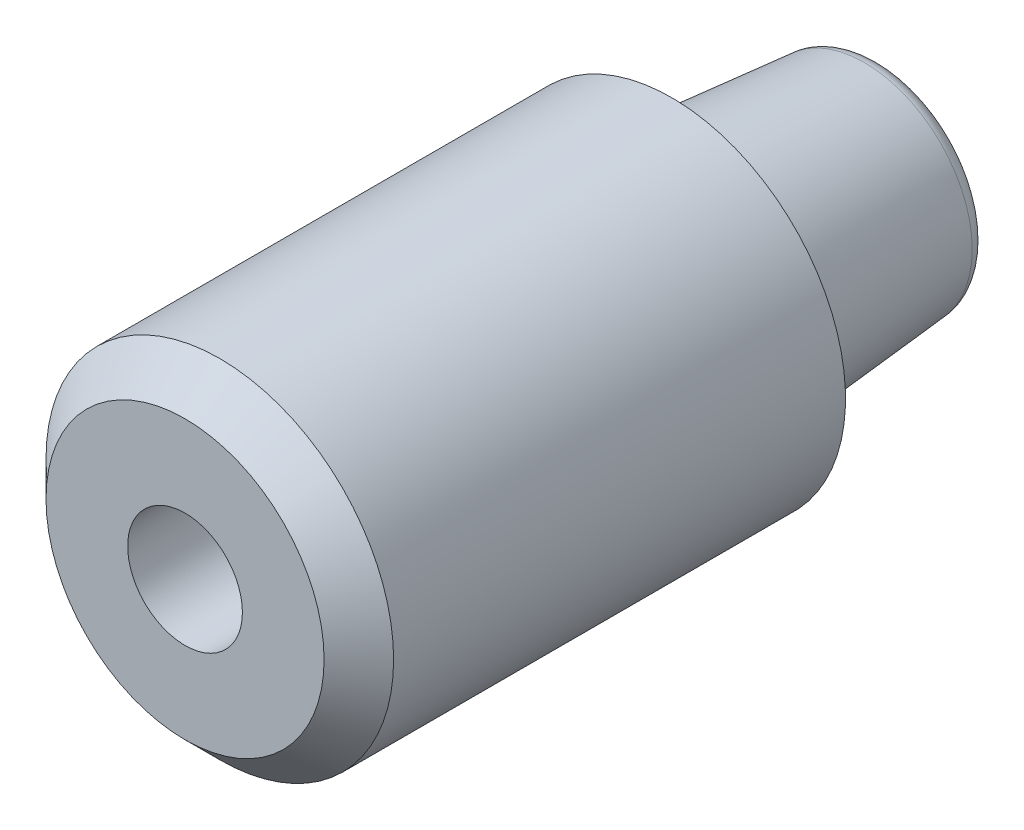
ISO-10303-21;
HEADER;
FILE_DESCRIPTION(('STEP AP214'),'2;1');
FILE_NAME('part.step','',(''),(''),'','','');
FILE_SCHEMA(('AUTOMOTIVE_DESIGN { 1 0 10303 214 1 1 1 1 }'));
ENDSEC;
DATA;
#1=APPLICATION_CONTEXT('core data for automotive mechanical design processes');
#2=APPLICATION_PROTOCOL_DEFINITION('international standard','automotive_design',2000,#1);
#3=PRODUCT_CONTEXT('',#1,'mechanical');
#4=PRODUCT('Part','Part','',(#3));
#5=PRODUCT_RELATED_PRODUCT_CATEGORY('part','',(#4));
#6=PRODUCT_DEFINITION_FORMATION('','',#4);
#7=PRODUCT_DEFINITION_CONTEXT('part definition',#1,'design');
#8=PRODUCT_DEFINITION('design','',#6,#7);
#9=PRODUCT_DEFINITION_SHAPE('','',#8);
#10=(LENGTH_UNIT() NAMED_UNIT(*) SI_UNIT(.MILLI.,.METRE.));
#11=(NAMED_UNIT(*) PLANE_ANGLE_UNIT() SI_UNIT($,.RADIAN.));
#12=(NAMED_UNIT(*) SI_UNIT($,.STERADIAN.) SOLID_ANGLE_UNIT());
#13=UNCERTAINTY_MEASURE_WITH_UNIT(LENGTH_MEASURE(1.E-05),#10,'distance_accuracy_value','');
#14=(GEOMETRIC_REPRESENTATION_CONTEXT(3) GLOBAL_UNCERTAINTY_ASSIGNED_CONTEXT((#13)) GLOBAL_UNIT_ASSIGNED_CONTEXT((#10,
#11,#12)) REPRESENTATION_CONTEXT('',''));
#15=CARTESIAN_POINT('',(0.,0.,0.));
#16=DIRECTION('',(0.,0.,1.));
#17=DIRECTION('',(1.,0.,0.));
#18=AXIS2_PLACEMENT_3D('',#15,#16,#17);
#19=CARTESIAN_POINT('',(0.,0.,11.9289321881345));
#20=DIRECTION('',(0.,0.,-1.));
#21=DIRECTION('',(1.,0.,0.));
#22=AXIS2_PLACEMENT_3D('',#19,#20,#21);
#23=CONICAL_SURFACE('',#22,7.07106781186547,0.785398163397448);
#24=CARTESIAN_POINT('',(1.04744440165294E-13,0.,15.));
#25=DIRECTION('',(0.,0.,-1.));
#26=DIRECTION('',(-1.,0.,0.));
#27=AXIS2_PLACEMENT_3D('',#24,#25,#26);
#28=CIRCLE('',#27,4.);
#29=CARTESIAN_POINT('',(-3.9999999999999,0.,15.));
#30=VERTEX_POINT('',#29);
#31=CARTESIAN_POINT('',(4.0000000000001,0.,15.));
#32=VERTEX_POINT('',#31);
#33=EDGE_CURVE('E59',#30,#32,#28,.T.);
#34=ORIENTED_EDGE('',*,*,#33,.T.);
#35=CARTESIAN_POINT('',(4.00000161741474,0.,14.9999983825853));
#36=CARTESIAN_POINT('',(5.00000126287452,0.,13.9999987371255));
#37=B_SPLINE_CURVE_WITH_KNOTS('',1,(#35,#36),.UNSPECIFIED.,.F.,.F.,(2,2),(0.56568565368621,
0.707106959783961),.UNSPECIFIED.);
#38=CARTESIAN_POINT('',(5.0000000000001,0.,14.));
#39=VERTEX_POINT('',#38);
#40=EDGE_CURVE('E46',#32,#39,#37,.T.);
#41=ORIENTED_EDGE('',*,*,#40,.T.);
#42=CARTESIAN_POINT('',(0.,0.,14.));
#43=DIRECTION('',(0.,0.,1.));
#44=DIRECTION('',(-1.,0.,0.));
#45=AXIS2_PLACEMENT_3D('',#42,#43,#44);
#46=CIRCLE('',#45,5.);
#47=CARTESIAN_POINT('',(-4.9999999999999,0.,14.));
#48=VERTEX_POINT('',#47);
#49=EDGE_CURVE('E97',#39,#48,#46,.T.);
#50=ORIENTED_EDGE('',*,*,#49,.T.);
#51=CARTESIAN_POINT('',(0.,0.,14.));
#52=DIRECTION('',(0.,0.,1.));
#53=DIRECTION('',(-1.,0.,0.));
#54=AXIS2_PLACEMENT_3D('',#51,#52,#53);
#55=CIRCLE('',#54,5.);
#56=EDGE_CURVE('E11',#48,#39,#55,.T.);
#57=ORIENTED_EDGE('',*,*,#56,.T.);
#58=ORIENTED_EDGE('',*,*,#40,.F.);
#59=CARTESIAN_POINT('',(1.04744440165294E-13,0.,15.));
#60=DIRECTION('',(0.,0.,-1.));
#61=DIRECTION('',(-1.,0.,0.));
#62=AXIS2_PLACEMENT_3D('',#59,#60,#61);
#63=CIRCLE('',#62,4.);
#64=EDGE_CURVE('E94',#32,#30,#63,.T.);
#65=ORIENTED_EDGE('',*,*,#64,.T.);
#66=EDGE_LOOP('',(#34,#41,#50,#57,#58,#65));
#67=FACE_BOUND('',#66,.T.);
#68=ADVANCED_FACE('F38',(#67),#23,.T.);
#69=CARTESIAN_POINT('',(0.,0.,8.));
#70=DIRECTION('',(0.,0.,-1.));
#71=DIRECTION('',(-1.,0.,0.));
#72=AXIS2_PLACEMENT_3D('',#69,#70,#71);
#73=CYLINDRICAL_SURFACE('',#72,5.);
#74=ORIENTED_EDGE('',*,*,#49,.F.);
#75=ORIENTED_EDGE('',*,*,#56,.F.);
#76=CARTESIAN_POINT('',(-4.9999999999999,0.,13.9999990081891));
#77=CARTESIAN_POINT('',(-5.,0.,0.999998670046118));
#78=B_SPLINE_CURVE_WITH_KNOTS('',1,(#76,#77),.UNSPECIFIED.,.F.,.F.,(2,2),(0.0833333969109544,
0.916666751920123),.UNSPECIFIED.);
#79=CARTESIAN_POINT('',(-5.,0.,1.00000000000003));
#80=VERTEX_POINT('',#79);
#81=EDGE_CURVE('E132',#48,#80,#78,.T.);
#82=ORIENTED_EDGE('',*,*,#81,.T.);
#83=CARTESIAN_POINT('',(0.,0.,1.));
#84=DIRECTION('',(0.,0.,-1.));
#85=DIRECTION('',(-1.,0.,0.));
#86=AXIS2_PLACEMENT_3D('',#83,#84,#85);
#87=CIRCLE('',#86,5.);
#88=EDGE_CURVE('E137',#80,#80,#87,.T.);
#89=ORIENTED_EDGE('',*,*,#88,.F.);
#90=ORIENTED_EDGE('',*,*,#81,.F.);
#91=EDGE_LOOP('',(#74,#75,#82,#89,#90));
#92=FACE_BOUND('',#91,.T.);
#93=ADVANCED_FACE('F182',(#92),#73,.T.);
#94=CARTESIAN_POINT('',(-5.1999999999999,-8.31384387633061,15.));
#95=DIRECTION('',(0.,0.,1.));
#96=DIRECTION('',(1.,0.,0.));
#97=AXIS2_PLACEMENT_3D('',#94,#95,#96);
#98=PLANE('',#97);
#99=CARTESIAN_POINT('',(0.,0.,15.));
#100=DIRECTION('',(0.,0.,1.));
#101=DIRECTION('',(1.,0.,0.));
#102=AXIS2_PLACEMENT_3D('',#99,#100,#101);
#103=CIRCLE('',#102,1.64999999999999);
#104=CARTESIAN_POINT('',(1.64999999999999,0.,15.));
#105=VERTEX_POINT('',#104);
#106=EDGE_CURVE('E95',#105,#105,#103,.T.);
#107=ORIENTED_EDGE('',*,*,#106,.F.);
#108=EDGE_LOOP('',(#107));
#109=FACE_BOUND('',#108,.T.);
#110=ORIENTED_EDGE('',*,*,#64,.F.);
#111=ORIENTED_EDGE('',*,*,#33,.F.);
#112=EDGE_LOOP('',(#110,#111));
#113=FACE_BOUND('',#112,.T.);
#114=ADVANCED_FACE('F185',(#109,#113),#98,.T.);
#115=CARTESIAN_POINT('',(0.,0.,-4.5));
#116=DIRECTION('',(0.,0.,-1.));
#117=DIRECTION('',(-1.,0.,0.));
#118=AXIS2_PLACEMENT_3D('',#115,#116,#117);
#119=TOROIDAL_SURFACE('',#118,2.60439109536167,0.5);
#120=CARTESIAN_POINT('',(0.,0.,-4.54357787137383));
#121=DIRECTION('',(0.,0.,-1.));
#122=DIRECTION('',(-1.,0.,0.));
#123=AXIS2_PLACEMENT_3D('',#120,#121,#122);
#124=CIRCLE('',#123,3.10248844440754);
#125=CARTESIAN_POINT('',(-3.10248844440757,0.,-4.54357787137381));
#126=VERTEX_POINT('',#125);
#127=EDGE_CURVE('E138',#126,#126,#124,.T.);
#128=ORIENTED_EDGE('',*,*,#127,.T.);
#129=CARTESIAN_POINT('',(-3.10248844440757,0.,-4.54357787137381));
#130=CARTESIAN_POINT('',(-3.06255668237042,0.,-4.99999999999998));
#131=CARTESIAN_POINT('',(-2.6043910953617,0.,-5.));
#132=(BOUNDED_CURVE() B_SPLINE_CURVE(2,(#129,#130,#131),.UNSPECIFIED.,.F.,
.F.) B_SPLINE_CURVE_WITH_KNOTS((3,3),(0.,0.5),
.UNSPECIFIED.) CURVE() GEOMETRIC_REPRESENTATION_ITEM() RATIONAL_B_SPLINE_CURVE((1.,
0.737277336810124,1.)) REPRESENTATION_ITEM(''));
#133=CARTESIAN_POINT('',(-2.6043910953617,0.,-5.));
#134=VERTEX_POINT('',#133);
#135=EDGE_CURVE('E121',#126,#134,#132,.T.);
#136=ORIENTED_EDGE('',*,*,#135,.T.);
#137=CARTESIAN_POINT('',(0.,0.,-5.));
#138=DIRECTION('',(0.,0.,1.));
#139=DIRECTION('',(-1.,0.,0.));
#140=AXIS2_PLACEMENT_3D('',#137,#138,#139);
#141=CIRCLE('',#140,2.60439109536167);
#142=EDGE_CURVE('E127',#134,#134,#141,.T.);
#143=ORIENTED_EDGE('',*,*,#142,.T.);
#144=ORIENTED_EDGE('',*,*,#135,.F.);
#145=EDGE_LOOP('',(#128,#136,#143,#144));
#146=FACE_BOUND('',#145,.T.);
#147=ADVANCED_FACE('F187',(#146),#119,.T.);
#148=CARTESIAN_POINT('',(0.,0.,0.));
#149=DIRECTION('',(0.,0.,1.));
#150=DIRECTION('',(-1.,0.,0.));
#151=AXIS2_PLACEMENT_3D('',#148,#149,#150);
#152=CONICAL_SURFACE('',#151,3.5,0.0872664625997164);
#153=ORIENTED_EDGE('',*,*,#127,.F.);
#154=CARTESIAN_POINT('',(-3.10248844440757,0.,-4.54357787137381));
#155=CARTESIAN_POINT('',(-3.5,0.,0.));
#156=B_SPLINE_CURVE_WITH_KNOTS('',1,(#154,#155),.UNSPECIFIED.,.F.,.F.,(2,2),(0.,1.),.UNSPECIFIED.);
#157=CARTESIAN_POINT('',(-3.5,0.,0.));
#158=VERTEX_POINT('',#157);
#159=EDGE_CURVE('E110',#126,#158,#156,.T.);
#160=ORIENTED_EDGE('',*,*,#159,.T.);
#161=CARTESIAN_POINT('',(0.,0.,0.));
#162=DIRECTION('',(0.,0.,-1.));
#163=DIRECTION('',(-1.,0.,0.));
#164=AXIS2_PLACEMENT_3D('',#161,#162,#163);
#165=CIRCLE('',#164,3.5);
#166=EDGE_CURVE('E116',#158,#158,#165,.T.);
#167=ORIENTED_EDGE('',*,*,#166,.T.);
#168=ORIENTED_EDGE('',*,*,#159,.F.);
#169=EDGE_LOOP('',(#153,#160,#167,#168));
#170=FACE_BOUND('',#169,.T.);
#171=ADVANCED_FACE('F194',(#170),#152,.T.);
#172=CARTESIAN_POINT('',(5.9900995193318,-5.41312523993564,-5.));
#173=DIRECTION('',(0.,0.,-1.));
#174=DIRECTION('',(-1.,0.,0.));
#175=AXIS2_PLACEMENT_3D('',#172,#173,#174);
#176=PLANE('',#175);
#177=ORIENTED_EDGE('',*,*,#142,.F.);
#178=EDGE_LOOP('',(#177));
#179=FACE_BOUND('',#178,.T.);
#180=ADVANCED_FACE('F222',(#179),#176,.T.);
#181=CARTESIAN_POINT('',(0.,0.,0.5));
#182=DIRECTION('',(0.,0.,-1.));
#183=DIRECTION('',(-1.,0.,0.));
#184=AXIS2_PLACEMENT_3D('',#181,#182,#183);
#185=CYLINDRICAL_SURFACE('',#184,3.5);
#186=CARTESIAN_POINT('',(0.,0.,1.));
#187=DIRECTION('',(0.,0.,1.));
#188=DIRECTION('',(-1.,0.,0.));
#189=AXIS2_PLACEMENT_3D('',#186,#187,#188);
#190=CIRCLE('',#189,3.5);
#191=CARTESIAN_POINT('',(-3.5,0.,1.00000000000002));
#192=VERTEX_POINT('',#191);
#193=EDGE_CURVE('E105',#192,#192,#190,.T.);
#194=ORIENTED_EDGE('',*,*,#193,.F.);
#195=CARTESIAN_POINT('',(-3.5,0.,1.00000305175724));
#196=CARTESIAN_POINT('',(-3.5,0.,5.31746900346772E-07));
#197=B_SPLINE_CURVE_WITH_KNOTS('',1,(#195,#196),.UNSPECIFIED.,.F.,.F.,(2,2),(0.0833307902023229,
0.91666622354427),.UNSPECIFIED.);
#198=EDGE_CURVE('E102',#192,#158,#197,.T.);
#199=ORIENTED_EDGE('',*,*,#198,.T.);
#200=ORIENTED_EDGE('',*,*,#166,.F.);
#201=ORIENTED_EDGE('',*,*,#198,.F.);
#202=EDGE_LOOP('',(#194,#199,#200,#201));
#203=FACE_BOUND('',#202,.T.);
#204=ADVANCED_FACE('F231',(#203),#185,.T.);
#205=CARTESIAN_POINT('',(11.5,-10.3923048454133,0.99999999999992));
#206=DIRECTION('',(0.,0.,-1.));
#207=DIRECTION('',(-1.,0.,0.));
#208=AXIS2_PLACEMENT_3D('',#205,#206,#207);
#209=PLANE('',#208);
#210=ORIENTED_EDGE('',*,*,#88,.T.);
#211=EDGE_LOOP('',(#210));
#212=FACE_BOUND('',#211,.T.);
#213=ORIENTED_EDGE('',*,*,#193,.T.);
#214=EDGE_LOOP('',(#213));
#215=FACE_BOUND('',#214,.T.);
#216=ADVANCED_FACE('F88',(#212,#215),#209,.T.);
#217=CARTESIAN_POINT('',(0.,0.,2.99999999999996));
#218=DIRECTION('',(0.,0.,1.));
#219=DIRECTION('',(1.,0.,0.));
#220=AXIS2_PLACEMENT_3D('',#217,#218,#219);
#221=CONICAL_SURFACE('',#220,1.65,1.02974425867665);
#222=CARTESIAN_POINT('',(0.,0.,2.00857997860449));
#223=VERTEX_POINT('',#222);
#224=VERTEX_LOOP('',#223);
#225=FACE_BOUND('',#224,.T.);
#226=CARTESIAN_POINT('',(0.,0.,2.99999999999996));
#227=DIRECTION('',(0.,0.,1.));
#228=DIRECTION('',(1.,0.,0.));
#229=AXIS2_PLACEMENT_3D('',#226,#227,#228);
#230=CIRCLE('',#229,1.65);
#231=CARTESIAN_POINT('',(1.65,0.,2.99999999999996));
#232=VERTEX_POINT('',#231);
#233=EDGE_CURVE('E92',#232,#232,#230,.T.);
#234=ORIENTED_EDGE('',*,*,#233,.T.);
#235=EDGE_LOOP('',(#234));
#236=FACE_BOUND('',#235,.T.);
#237=ADVANCED_FACE('F84',(#225,#236),#221,.F.);
#238=CARTESIAN_POINT('',(0.,0.,15.));
#239=DIRECTION('',(0.,0.,1.));
#240=DIRECTION('',(1.,0.,0.));
#241=AXIS2_PLACEMENT_3D('',#238,#239,#240);
#242=CYLINDRICAL_SURFACE('',#241,1.64999999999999);
#243=ORIENTED_EDGE('',*,*,#233,.F.);
#244=EDGE_LOOP('',(#243));
#245=FACE_BOUND('',#244,.T.);
#246=ORIENTED_EDGE('',*,*,#106,.T.);
#247=EDGE_LOOP('',(#246));
#248=FACE_BOUND('',#247,.T.);
#249=ADVANCED_FACE('F87',(#245,#248),#242,.F.);
#250=CLOSED_SHELL('',(#68,#93,#114,#147,#171,#180,#204,#216,#237,#249));
#251=MANIFOLD_SOLID_BREP('B2',#250);
#252=ADVANCED_BREP_SHAPE_REPRESENTATION('',(#18,#251),#14);
#253=SHAPE_DEFINITION_REPRESENTATION(#9,#252);
ENDSEC;
END-ISO-10303-21;
